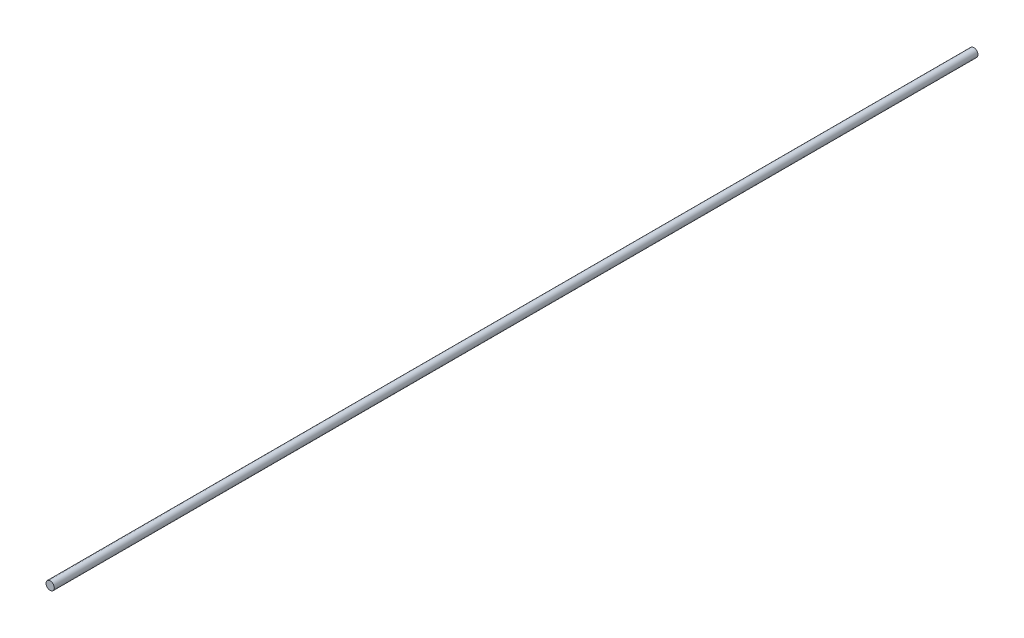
ISO-10303-21;
HEADER;
FILE_DESCRIPTION(('STEP AP214'),'2;1');
FILE_NAME('part.step','',(''),(''),'','','');
FILE_SCHEMA(('AUTOMOTIVE_DESIGN { 1 0 10303 214 1 1 1 1 }'));
ENDSEC;
DATA;
#1=APPLICATION_CONTEXT('core data for automotive mechanical design processes');
#2=APPLICATION_PROTOCOL_DEFINITION('international standard','automotive_design',2000,#1);
#3=PRODUCT_CONTEXT('',#1,'mechanical');
#4=PRODUCT('Part','Part','',(#3));
#5=PRODUCT_RELATED_PRODUCT_CATEGORY('part','',(#4));
#6=PRODUCT_DEFINITION_FORMATION('','',#4);
#7=PRODUCT_DEFINITION_CONTEXT('part definition',#1,'design');
#8=PRODUCT_DEFINITION('design','',#6,#7);
#9=PRODUCT_DEFINITION_SHAPE('','',#8);
#10=(LENGTH_UNIT() NAMED_UNIT(*) SI_UNIT(.MILLI.,.METRE.));
#11=(NAMED_UNIT(*) PLANE_ANGLE_UNIT() SI_UNIT($,.RADIAN.));
#12=(NAMED_UNIT(*) SI_UNIT($,.STERADIAN.) SOLID_ANGLE_UNIT());
#13=UNCERTAINTY_MEASURE_WITH_UNIT(LENGTH_MEASURE(1.E-05),#10,'distance_accuracy_value','');
#14=(GEOMETRIC_REPRESENTATION_CONTEXT(3) GLOBAL_UNCERTAINTY_ASSIGNED_CONTEXT((#13)) GLOBAL_UNIT_ASSIGNED_CONTEXT((#10,
#11,#12)) REPRESENTATION_CONTEXT('',''));
#15=CARTESIAN_POINT('',(0.,0.,0.));
#16=DIRECTION('',(0.,0.,1.));
#17=DIRECTION('',(1.,0.,0.));
#18=AXIS2_PLACEMENT_3D('',#15,#16,#17);
#19=CARTESIAN_POINT('',(0.,0.,2000.));
#20=DIRECTION('',(0.,0.,-1.));
#21=DIRECTION('',(-1.,0.,0.));
#22=AXIS2_PLACEMENT_3D('',#19,#20,#21);
#23=CYLINDRICAL_SURFACE('',#22,9.);
#24=CARTESIAN_POINT('',(0.,0.,2000.));
#25=DIRECTION('',(0.,0.,1.));
#26=DIRECTION('',(1.,0.,0.));
#27=AXIS2_PLACEMENT_3D('',#24,#25,#26);
#28=CIRCLE('',#27,9.);
#29=CARTESIAN_POINT('',(9.,0.,2000.));
#30=VERTEX_POINT('',#29);
#31=EDGE_CURVE('E10',#30,#30,#28,.T.);
#32=ORIENTED_EDGE('',*,*,#31,.F.);
#33=EDGE_LOOP('',(#32));
#34=FACE_BOUND('',#33,.T.);
#35=CARTESIAN_POINT('',(0.,0.,0.));
#36=DIRECTION('',(0.,0.,1.));
#37=DIRECTION('',(1.,0.,0.));
#38=AXIS2_PLACEMENT_3D('',#35,#36,#37);
#39=CIRCLE('',#38,9.);
#40=CARTESIAN_POINT('',(9.,0.,0.));
#41=VERTEX_POINT('',#40);
#42=EDGE_CURVE('E31',#41,#41,#39,.T.);
#43=ORIENTED_EDGE('',*,*,#42,.T.);
#44=EDGE_LOOP('',(#43));
#45=FACE_BOUND('',#44,.T.);
#46=ADVANCED_FACE('F28',(#34,#45),#23,.T.);
#47=CARTESIAN_POINT('',(0.,0.,2000.));
#48=DIRECTION('',(0.,0.,1.));
#49=DIRECTION('',(1.,0.,0.));
#50=AXIS2_PLACEMENT_3D('',#47,#48,#49);
#51=PLANE('',#50);
#52=ORIENTED_EDGE('',*,*,#31,.T.);
#53=EDGE_LOOP('',(#52));
#54=FACE_BOUND('',#53,.T.);
#55=ADVANCED_FACE('F43',(#54),#51,.T.);
#56=CARTESIAN_POINT('',(0.,0.,0.));
#57=DIRECTION('',(0.,0.,1.));
#58=DIRECTION('',(1.,0.,0.));
#59=AXIS2_PLACEMENT_3D('',#56,#57,#58);
#60=PLANE('',#59);
#61=ORIENTED_EDGE('',*,*,#42,.F.);
#62=EDGE_LOOP('',(#61));
#63=FACE_BOUND('',#62,.T.);
#64=ADVANCED_FACE('F41',(#63),#60,.F.);
#65=CLOSED_SHELL('',(#46,#55,#64));
#66=MANIFOLD_SOLID_BREP('B2',#65);
#67=ADVANCED_BREP_SHAPE_REPRESENTATION('',(#18,#66),#14);
#68=SHAPE_DEFINITION_REPRESENTATION(#9,#67);
ENDSEC;
END-ISO-10303-21;
